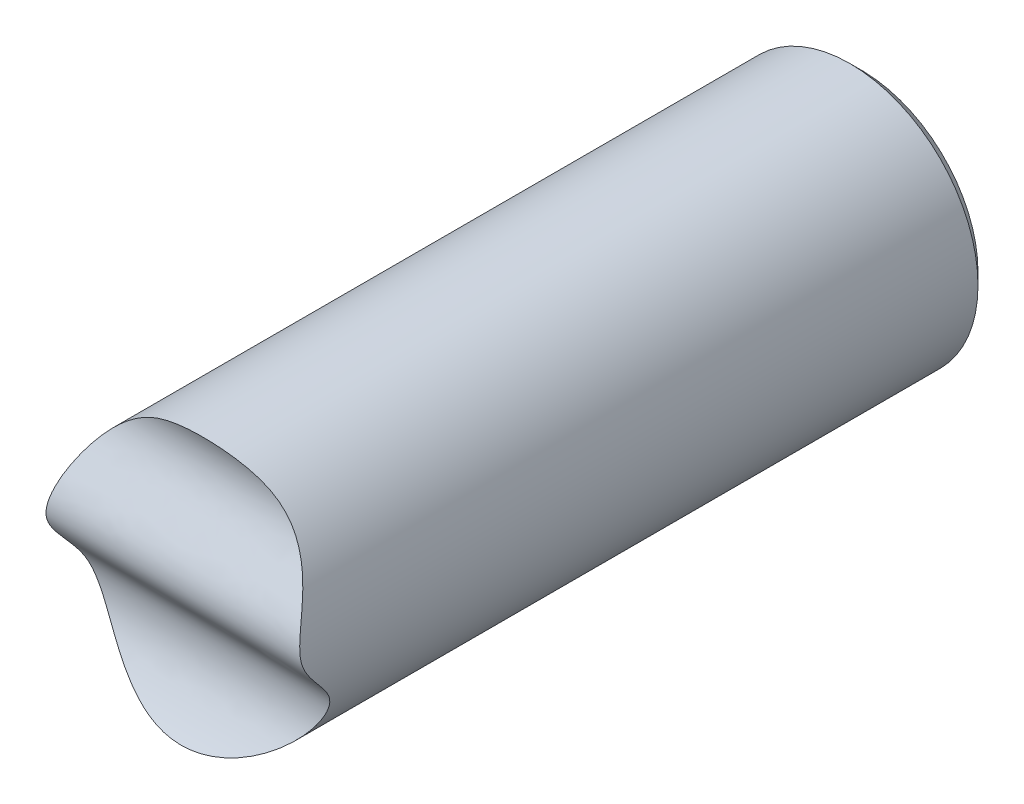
from build123d import *

# Parameters (mm, degrees)
ESQUISSE1_R                  = 11
EXTRUSION1_DEPTH             = 60
CHANFREIN1_SIZE              = 1
ENL_V_MAT_EXTRU_1_DEPTH      = 63.393021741
ENL_V_MAT_EXTRU_1_DEPTH_BACK = 63.393021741
TROU_TARAUD_M12X1_251_D      = 10.8
TROU_TARAUD_M12X1_251_DEPTH  = 23.75
TROU_TARAUD_M12X1_251_TIP    = 3.244647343


with BuildPart() as part:
    # Esquisse1 → Extrusion1 (new body)
    with BuildSketch(Plane.XY):
        with Locations((2.110650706, 0)):
            Circle(ESQUISSE1_R)
    extrude(amount=EXTRUSION1_DEPTH)

    # Chanfrein1
    chanfrein1_edges = [part.edges().sort_by_distance(p)[0] for p in [
        (-8.889349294, 0, 0),
    ]]
    chamfer(chanfrein1_edges, length=CHANFREIN1_SIZE)

    # Esquisse2 → Enl_v. mat.-Extru.1 (cut, two sides: drawn at the far end of the back side and taken through both)
    with BuildSketch(Plane(origin=(0, 0, 0), x_dir=(0, 0, -1), z_dir=(1, 0, 0)).offset(-ENL_V_MAT_EXTRU_1_DEPTH_BACK)):
        with BuildLine():
            add(Edge.make_bspline(
                [(-60.21652994, 15.701211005), (-59.40263245, 15.181649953), (-57.704094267, 12.996684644), (-55.484031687, 9.477802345), (-57.541820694, 5.352941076), (-60.391869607, 0.477729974), (-55.050162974, -3.103332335), (-56.359982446, -9.409410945), (-69.940115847, -22.434298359), (-66.646796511, 19.806047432), (-60.21652994, 15.701211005)],
                knots=[0, 0, 0, 0, 0.058243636, 0.113086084, 0.188288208, 0.260641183, 0.343591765, 0.42335391, 0.539841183, 1, 1, 1, 1], degree=3))
        make_face()
    extrude(amount=ENL_V_MAT_EXTRU_1_DEPTH + ENL_V_MAT_EXTRU_1_DEPTH_BACK, mode=Mode.SUBTRACT)

    # Trou taraud_ M12x1.251
    with Locations(Plane(origin=(0, 0, 0), x_dir=(-1, 0, 0), z_dir=(0, 0, -1))):
        with Locations((-2.110650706, 0)):
            Hole(TROU_TARAUD_M12X1_251_D / 2, depth=TROU_TARAUD_M12X1_251_DEPTH)
            with Locations((0, 0, -(TROU_TARAUD_M12X1_251_DEPTH + TROU_TARAUD_M12X1_251_TIP / 2))):  # 118° drill point
                Cone(0, TROU_TARAUD_M12X1_251_D / 2, TROU_TARAUD_M12X1_251_TIP, mode=Mode.SUBTRACT)


solid = part.part
